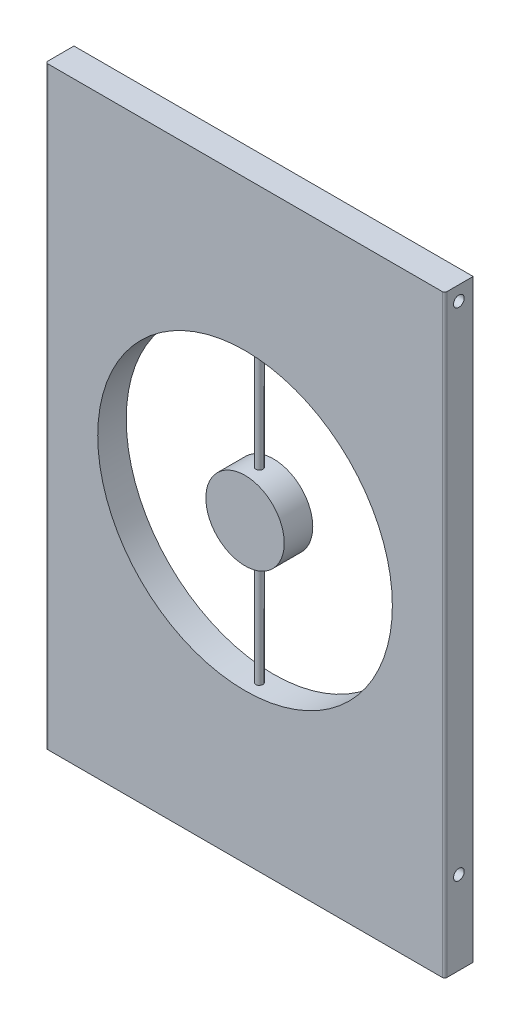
ISO-10303-21;
HEADER;
FILE_DESCRIPTION(('STEP AP214'),'2;1');
FILE_NAME('part.step','',(''),(''),'','','');
FILE_SCHEMA(('AUTOMOTIVE_DESIGN { 1 0 10303 214 1 1 1 1 }'));
ENDSEC;
DATA;
#1=APPLICATION_CONTEXT('core data for automotive mechanical design processes');
#2=APPLICATION_PROTOCOL_DEFINITION('international standard','automotive_design',2000,#1);
#3=PRODUCT_CONTEXT('',#1,'mechanical');
#4=PRODUCT('Part','Part','',(#3));
#5=PRODUCT_RELATED_PRODUCT_CATEGORY('part','',(#4));
#6=PRODUCT_DEFINITION_FORMATION('','',#4);
#7=PRODUCT_DEFINITION_CONTEXT('part definition',#1,'design');
#8=PRODUCT_DEFINITION('design','',#6,#7);
#9=PRODUCT_DEFINITION_SHAPE('','',#8);
#10=(LENGTH_UNIT() NAMED_UNIT(*) SI_UNIT(.MILLI.,.METRE.));
#11=(NAMED_UNIT(*) PLANE_ANGLE_UNIT() SI_UNIT($,.RADIAN.));
#12=(NAMED_UNIT(*) SI_UNIT($,.STERADIAN.) SOLID_ANGLE_UNIT());
#13=UNCERTAINTY_MEASURE_WITH_UNIT(LENGTH_MEASURE(1.E-05),#10,'distance_accuracy_value','');
#14=(GEOMETRIC_REPRESENTATION_CONTEXT(3) GLOBAL_UNCERTAINTY_ASSIGNED_CONTEXT((#13)) GLOBAL_UNIT_ASSIGNED_CONTEXT((#10,
#11,#12)) REPRESENTATION_CONTEXT('',''));
#15=CARTESIAN_POINT('',(0.,0.,0.));
#16=DIRECTION('',(0.,0.,1.));
#17=DIRECTION('',(1.,0.,0.));
#18=AXIS2_PLACEMENT_3D('',#15,#16,#17);
#19=CARTESIAN_POINT('',(144.,67.,99.));
#20=DIRECTION('',(0.,1.,0.));
#21=DIRECTION('',(0.,0.,1.));
#22=AXIS2_PLACEMENT_3D('',#19,#20,#21);
#23=CYLINDRICAL_SURFACE('',#22,1.5);
#24=CARTESIAN_POINT('',(144.,120.5,100.5));
#25=CARTESIAN_POINT('',(144.084069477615,120.500000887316,100.499996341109));
#26=CARTESIAN_POINT('',(144.168195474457,120.500649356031,100.492908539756));
#27=CARTESIAN_POINT('',(144.334117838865,120.503173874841,100.464739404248));
#28=CARTESIAN_POINT('',(144.415911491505,120.505051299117,100.44364240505));
#29=CARTESIAN_POINT('',(144.574742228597,120.509821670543,100.388071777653));
#30=CARTESIAN_POINT('',(144.651782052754,120.512714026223,100.353605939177));
#31=CARTESIAN_POINT('',(144.798965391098,120.519190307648,100.272290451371));
#32=CARTESIAN_POINT('',(144.869110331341,120.522774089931,100.225443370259));
#33=CARTESIAN_POINT('',(145.000741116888,120.530243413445,100.120543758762));
#34=CARTESIAN_POINT('',(145.062203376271,120.534129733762,100.062461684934));
#35=CARTESIAN_POINT('',(145.17452157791,120.541759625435,99.9368035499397));
#36=CARTESIAN_POINT('',(145.225377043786,120.545503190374,99.8692270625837));
#37=CARTESIAN_POINT('',(145.315119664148,120.552431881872,99.7263532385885));
#38=CARTESIAN_POINT('',(145.353985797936,120.555616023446,99.6510426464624));
#39=CARTESIAN_POINT('',(145.418512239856,120.561056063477,99.4949305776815));
#40=CARTESIAN_POINT('',(145.44417282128,120.563311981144,99.4141292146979));
#41=CARTESIAN_POINT('',(145.481490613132,120.566633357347,99.2495676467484));
#42=CARTESIAN_POINT('',(145.493186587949,120.567702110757,99.1658163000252));
#43=CARTESIAN_POINT('',(145.502362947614,120.568538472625,98.9975329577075));
#44=CARTESIAN_POINT('',(145.499843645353,120.568306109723,98.9130009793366));
#45=CARTESIAN_POINT('',(145.480692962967,120.566569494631,98.745822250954));
#46=CARTESIAN_POINT('',(145.464103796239,120.565069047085,98.6631706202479));
#47=CARTESIAN_POINT('',(145.417349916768,120.560971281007,98.5018296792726));
#48=CARTESIAN_POINT('',(145.387185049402,120.558373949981,98.4231404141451));
#49=CARTESIAN_POINT('',(145.314089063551,120.552370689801,98.2718238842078));
#50=CARTESIAN_POINT('',(145.271139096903,120.548963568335,98.199205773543));
#51=CARTESIAN_POINT('',(145.173705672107,120.541725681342,98.0621930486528));
#52=CARTESIAN_POINT('',(145.11922193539,120.537894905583,97.99779863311));
#53=CARTESIAN_POINT('',(145.00003122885,120.530224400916,97.8788158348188));
#54=CARTESIAN_POINT('',(144.935287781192,120.526384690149,97.8242639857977));
#55=CARTESIAN_POINT('',(144.797542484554,120.51914217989,97.7267976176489));
#56=CARTESIAN_POINT('',(144.724540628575,120.515739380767,97.6838831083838));
#57=CARTESIAN_POINT('',(144.572326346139,120.509753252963,97.6109115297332));
#58=CARTESIAN_POINT('',(144.49311309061,120.507170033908,97.5808561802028));
#59=CARTESIAN_POINT('',(144.33073592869,120.503115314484,97.5344821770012));
#60=CARTESIAN_POINT('',(144.247572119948,120.50164378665,97.5181631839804));
#61=CARTESIAN_POINT('',(144.079971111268,120.499981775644,97.4997711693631));
#62=CARTESIAN_POINT('',(143.995539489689,120.499786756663,97.4976477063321));
#63=CARTESIAN_POINT('',(143.827521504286,120.500687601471,97.5075747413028));
#64=CARTESIAN_POINT('',(143.743935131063,120.501783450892,97.5196250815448));
#65=CARTESIAN_POINT('',(143.580124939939,120.505139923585,97.5575158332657));
#66=CARTESIAN_POINT('',(143.499895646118,120.507398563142,97.5833327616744));
#67=CARTESIAN_POINT('',(143.344907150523,120.512827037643,97.6479997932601));
#68=CARTESIAN_POINT('',(143.270148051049,120.515996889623,97.6868501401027));
#69=CARTESIAN_POINT('',(143.127993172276,120.522904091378,97.7766072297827));
#70=CARTESIAN_POINT('',(143.060618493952,120.526642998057,97.8275472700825));
#71=CARTESIAN_POINT('',(142.935358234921,120.534263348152,97.9399898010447));
#72=CARTESIAN_POINT('',(142.87747285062,120.538144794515,98.0014925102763));
#73=CARTESIAN_POINT('',(142.772660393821,120.545626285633,98.1335339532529));
#74=CARTESIAN_POINT('',(142.7257663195,120.549225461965,98.2040989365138));
#75=CARTESIAN_POINT('',(142.644494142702,120.555722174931,98.3521317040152));
#76=CARTESIAN_POINT('',(142.610115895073,120.558619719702,98.429599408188));
#77=CARTESIAN_POINT('',(142.554907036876,120.563379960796,98.5891233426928));
#78=CARTESIAN_POINT('',(142.534056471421,120.565244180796,98.6711726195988));
#79=CARTESIAN_POINT('',(142.506429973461,120.567731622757,98.8376252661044));
#80=CARTESIAN_POINT('',(142.499653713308,120.568354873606,98.9220285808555));
#81=CARTESIAN_POINT('',(142.500372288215,120.568289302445,99.090465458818));
#82=CARTESIAN_POINT('',(142.507815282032,120.567605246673,99.174499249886));
#83=CARTESIAN_POINT('',(142.536652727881,120.565012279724,99.3401177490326));
#84=CARTESIAN_POINT('',(142.558047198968,120.563103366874,99.4217024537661));
#85=CARTESIAN_POINT('',(142.614166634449,120.558277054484,99.580108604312));
#86=CARTESIAN_POINT('',(142.64889040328,120.555359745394,99.6569304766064));
#87=CARTESIAN_POINT('',(142.730677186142,120.548845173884,99.8036632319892));
#88=CARTESIAN_POINT('',(142.777740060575,120.545247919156,99.8735741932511));
#89=CARTESIAN_POINT('',(142.883064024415,120.537763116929,100.004766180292));
#90=CARTESIAN_POINT('',(142.941363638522,120.533874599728,100.066016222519));
#91=CARTESIAN_POINT('',(143.067432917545,120.526254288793,100.177888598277));
#92=CARTESIAN_POINT('',(143.135204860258,120.522522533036,100.228508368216));
#93=CARTESIAN_POINT('',(143.278449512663,120.515628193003,100.31776490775));
#94=CARTESIAN_POINT('',(143.353938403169,120.512466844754,100.356375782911));
#95=CARTESIAN_POINT('',(143.510306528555,120.507083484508,100.420323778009));
#96=CARTESIAN_POINT('',(143.591179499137,120.504860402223,100.445676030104));
#97=CARTESIAN_POINT('',(143.727101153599,120.502169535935,100.475988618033));
#98=CARTESIAN_POINT('',(143.781277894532,120.501359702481,100.484980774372));
#99=CARTESIAN_POINT('',(143.890295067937,120.500274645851,100.496987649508));
#100=CARTESIAN_POINT('',(143.945135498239,120.49999942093,100.500002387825));
#101=CARTESIAN_POINT('',(144.,120.5,100.5));
#102=B_SPLINE_CURVE_WITH_KNOTS('',3,(#24,#25,#26,#27,#28,#29,#30,#31,#32,#33,#34,#35,#36,#37,
#38,#39,#40,#41,#42,#43,#44,#45,#46,#47,#48,#49,#50,#51,#52,#53,#54,#55,#56,#57,#58,#59,#60,#61,
#62,#63,#64,#65,#66,#67,#68,#69,#70,#71,#72,#73,#74,#75,#76,#77,#78,#79,#80,#81,#82,#83,#84,#85,
#86,#87,#88,#89,#90,#91,#92,#93,#94,#95,#96,#97,#98,#99,#100,#101),.UNSPECIFIED.,.T.,.F.,(4,2,2,
2,2,2,2,2,2,2,2,2,2,2,2,2,2,2,2,2,2,2,2,2,2,2,2,2,2,2,2,2,2,2,2,2,2,2,4),(0.,0.252008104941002,
0.504298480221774,0.756442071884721,1.00853340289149,1.26129687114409,1.51407168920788,
1.76728720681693,2.02049748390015,2.27300322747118,2.52550341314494,2.77724869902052,
3.02899685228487,3.28111799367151,3.53324522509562,3.78628987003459,4.03933472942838,
4.29241342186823,4.5454858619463,4.79765857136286,5.04982847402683,5.30156959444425,
5.55331542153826,5.80576282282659,6.05821544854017,6.31141654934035,6.56461471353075,
6.81743852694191,7.07025645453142,7.32215440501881,7.57405269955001,7.82592840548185,
8.07780126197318,8.33055352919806,8.58336668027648,8.83672124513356,9.08978602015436,
9.25424932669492,9.41871209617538),.UNSPECIFIED.);
#103=CARTESIAN_POINT('',(144.,120.5,100.5));
#104=VERTEX_POINT('',#103);
#105=EDGE_CURVE('E194',#104,#104,#102,.T.);
#106=ORIENTED_EDGE('',*,*,#105,.F.);
#107=EDGE_LOOP('',(#106));
#108=FACE_BOUND('',#107,.T.);
#109=CARTESIAN_POINT('',(144.,75.0000000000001,100.5));
#110=CARTESIAN_POINT('',(143.915757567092,75.000000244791,100.49999626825));
#111=CARTESIAN_POINT('',(143.831454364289,75.0001735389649,100.492879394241));
#112=CARTESIAN_POINT('',(143.665170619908,75.0008481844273,100.464588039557));
#113=CARTESIAN_POINT('',(143.583192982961,75.001349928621,100.443396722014));
#114=CARTESIAN_POINT('',(143.423993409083,75.0026246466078,100.387560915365));
#115=CARTESIAN_POINT('',(143.346769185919,75.0033974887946,100.352922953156));
#116=CARTESIAN_POINT('',(143.199253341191,75.0051272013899,100.271186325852));
#117=CARTESIAN_POINT('',(143.128960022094,75.0060840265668,100.22409072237));
#118=CARTESIAN_POINT('',(142.997255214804,75.0080743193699,100.118755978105));
#119=CARTESIAN_POINT('',(142.93584628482,75.0091078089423,100.060513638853));
#120=CARTESIAN_POINT('',(142.823674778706,75.0111347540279,99.9345437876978));
#121=CARTESIAN_POINT('',(142.772912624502,75.0121282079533,99.8668159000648));
#122=CARTESIAN_POINT('',(142.683473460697,75.0139631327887,99.7237903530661));
#123=CARTESIAN_POINT('',(142.644797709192,75.014804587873,99.6484919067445));
#124=CARTESIAN_POINT('',(142.580637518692,75.0162404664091,99.4924683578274));
#125=CARTESIAN_POINT('',(142.555153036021,75.0168348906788,99.4117432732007));
#126=CARTESIAN_POINT('',(142.518103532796,75.0177095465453,99.2471746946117));
#127=CARTESIAN_POINT('',(142.506535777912,75.0179898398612,99.1633318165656));
#128=CARTESIAN_POINT('',(142.497639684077,75.0182048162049,98.9948937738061));
#129=CARTESIAN_POINT('',(142.50031129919,75.0181395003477,98.9102986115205));
#130=CARTESIAN_POINT('',(142.519815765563,75.0176706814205,98.7427759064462));
#131=CARTESIAN_POINT('',(142.536645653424,75.0172672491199,98.6598480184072));
#132=CARTESIAN_POINT('',(142.583984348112,75.0161677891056,98.4979949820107));
#133=CARTESIAN_POINT('',(142.614493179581,75.0154717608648,98.4190698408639));
#134=CARTESIAN_POINT('',(142.688327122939,75.0138654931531,98.2674532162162));
#135=CARTESIAN_POINT('',(142.731653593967,75.0129552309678,98.1947623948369));
#136=CARTESIAN_POINT('',(142.829891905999,75.0110231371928,98.0576851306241));
#137=CARTESIAN_POINT('',(142.884803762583,75.0100013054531,97.9932986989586));
#138=CARTESIAN_POINT('',(143.004670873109,75.0079609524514,97.874640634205));
#139=CARTESIAN_POINT('',(143.069628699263,75.0069424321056,97.8203715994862));
#140=CARTESIAN_POINT('',(143.207734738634,75.0050237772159,97.7235088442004));
#141=CARTESIAN_POINT('',(143.280882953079,75.0041236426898,97.6809151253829));
#142=CARTESIAN_POINT('',(143.43329476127,75.0025432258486,97.6086123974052));
#143=CARTESIAN_POINT('',(143.512558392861,75.0018629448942,97.5789034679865));
#144=CARTESIAN_POINT('',(143.67495035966,75.0007989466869,97.5332153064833));
#145=CARTESIAN_POINT('',(143.758078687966,75.0004152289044,97.5172360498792));
#146=CARTESIAN_POINT('',(143.925817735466,74.9999876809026,97.4994640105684));
#147=CARTESIAN_POINT('',(144.010428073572,74.9999437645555,97.4976676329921));
#148=CARTESIAN_POINT('',(144.178749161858,75.0002005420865,97.5083029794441));
#149=CARTESIAN_POINT('',(144.262459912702,75.0005012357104,97.5207346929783));
#150=CARTESIAN_POINT('',(144.426595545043,75.0014132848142,97.5594703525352));
#151=CARTESIAN_POINT('',(144.507020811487,75.0020246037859,97.5857726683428));
#152=CARTESIAN_POINT('',(144.662314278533,75.0034890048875,97.6515012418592));
#153=CARTESIAN_POINT('',(144.737182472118,75.0043420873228,97.6909275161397));
#154=CARTESIAN_POINT('',(144.879253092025,75.0061941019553,97.7817940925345));
#155=CARTESIAN_POINT('',(144.946453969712,75.0071930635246,97.8332368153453));
#156=CARTESIAN_POINT('',(145.071266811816,75.0092241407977,97.9466724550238));
#157=CARTESIAN_POINT('',(145.128878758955,75.0102562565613,98.0086653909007));
#158=CARTESIAN_POINT('',(145.232890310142,75.0122375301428,98.1414570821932));
#159=CARTESIAN_POINT('',(145.279287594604,75.0131866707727,98.2122576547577));
#160=CARTESIAN_POINT('',(145.359536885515,75.0148947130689,98.360645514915));
#161=CARTESIAN_POINT('',(145.393388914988,75.0156536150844,98.4382327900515));
#162=CARTESIAN_POINT('',(145.447582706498,75.0168954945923,98.5979828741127));
#163=CARTESIAN_POINT('',(145.467925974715,75.017378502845,98.6801451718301));
#164=CARTESIAN_POINT('',(145.494529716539,75.0180142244,98.8467203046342));
#165=CARTESIAN_POINT('',(145.500790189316,75.0181669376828,98.9311331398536));
#166=CARTESIAN_POINT('',(145.499050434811,75.0181248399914,99.0997898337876));
#167=CARTESIAN_POINT('',(145.491053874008,75.0179301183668,99.1840337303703));
#168=CARTESIAN_POINT('',(145.461034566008,75.0172152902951,99.349982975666));
#169=CARTESIAN_POINT('',(145.439011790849,75.0166951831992,99.4316883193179));
#170=CARTESIAN_POINT('',(145.381565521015,75.0153882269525,99.5902430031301));
#171=CARTESIAN_POINT('',(145.346141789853,75.0146013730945,99.6670922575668));
#172=CARTESIAN_POINT('',(145.262900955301,75.0128496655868,99.8137507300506));
#173=CARTESIAN_POINT('',(145.215084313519,75.0118848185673,99.8835602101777));
#174=CARTESIAN_POINT('',(145.108406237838,75.0098856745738,100.01417308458));
#175=CARTESIAN_POINT('',(145.049543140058,75.0088513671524,100.074975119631));
#176=CARTESIAN_POINT('',(144.922427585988,75.0068297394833,100.185850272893));
#177=CARTESIAN_POINT('',(144.854172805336,75.0058424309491,100.235920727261));
#178=CARTESIAN_POINT('',(144.710189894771,75.0040258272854,100.323917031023));
#179=CARTESIAN_POINT('',(144.634457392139,75.0031966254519,100.361835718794));
#180=CARTESIAN_POINT('',(144.47775796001,75.0017914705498,100.424376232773));
#181=CARTESIAN_POINT('',(144.396797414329,75.0012152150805,100.449013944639));
#182=CARTESIAN_POINT('',(144.262769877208,75.0005352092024,100.477750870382));
#183=CARTESIAN_POINT('',(144.210573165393,75.0003353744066,100.486083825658));
#184=CARTESIAN_POINT('',(144.105592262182,75.0000676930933,100.49720955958));
#185=CARTESIAN_POINT('',(144.052808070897,74.9999998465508,100.500002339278));
#186=CARTESIAN_POINT('',(144.,75.0000000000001,100.5));
#187=B_SPLINE_CURVE_WITH_KNOTS('',3,(#109,#110,#111,#112,#113,#114,#115,#116,#117,#118,#119,
#120,#121,#122,#123,#124,#125,#126,#127,#128,#129,#130,#131,#132,#133,#134,#135,#136,#137,#138,
#139,#140,#141,#142,#143,#144,#145,#146,#147,#148,#149,#150,#151,#152,#153,#154,#155,#156,#157,
#158,#159,#160,#161,#162,#163,#164,#165,#166,#167,#168,#169,#170,#171,#172,#173,#174,#175,#176,
#177,#178,#179,#180,#181,#182,#183,#184,#185,#186),.UNSPECIFIED.,.T.,.F.,(4,2,2,2,2,2,2,2,2,2,2,
2,2,2,2,2,2,2,2,2,2,2,2,2,2,2,2,2,2,2,2,2,2,2,2,2,2,2,4),(0.,0.252534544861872,
0.505371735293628,0.758086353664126,1.01073892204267,1.26346409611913,1.51619928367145,
1.76896077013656,2.02172141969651,2.27443239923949,2.52714256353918,2.77979984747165,
3.03245758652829,3.28514212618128,3.5378270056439,3.79057669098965,4.04332641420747,
4.29607770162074,4.54882853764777,4.80151530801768,5.05420189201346,5.30685878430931,
5.55951599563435,5.81222414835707,6.06493275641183,6.31769358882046,6.57045395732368,
6.8231861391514,7.07591833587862,7.32858554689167,7.58125326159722,7.83392543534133,
8.08658819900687,8.33928905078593,8.59205255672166,8.84496475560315,9.09757376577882,
9.25587717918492,9.41418056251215),.UNSPECIFIED.);
#188=CARTESIAN_POINT('',(144.,75.0000000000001,100.5));
#189=VERTEX_POINT('',#188);
#190=EDGE_CURVE('E154',#189,#189,#187,.T.);
#191=ORIENTED_EDGE('',*,*,#190,.F.);
#192=EDGE_LOOP('',(#191));
#193=FACE_BOUND('',#192,.T.);
#194=ADVANCED_FACE('F35',(#108,#193),#23,.T.);
#195=CARTESIAN_POINT('',(60.,12.,93.));
#196=DIRECTION('',(-1.,0.,0.));
#197=DIRECTION('',(0.,0.,1.));
#198=AXIS2_PLACEMENT_3D('',#195,#196,#197);
#199=PLANE('',#198);
#200=CARTESIAN_POINT('',(60.,256.,99.));
#201=DIRECTION('',(-1.,0.,0.));
#202=DIRECTION('',(0.,0.,1.));
#203=AXIS2_PLACEMENT_3D('',#200,#201,#202);
#204=CIRCLE('',#203,2.24999999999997);
#205=CARTESIAN_POINT('',(60.,256.,101.25));
#206=VERTEX_POINT('',#205);
#207=EDGE_CURVE('E117',#206,#206,#204,.T.);
#208=ORIENTED_EDGE('',*,*,#207,.F.);
#209=EDGE_LOOP('',(#208));
#210=FACE_BOUND('',#209,.T.);
#211=DIRECTION('',(0.,0.,1.));
#212=VECTOR('',#211,1.);
#213=CARTESIAN_POINT('',(60.,12.,93.));
#214=LINE('',#213,#212);
#215=CARTESIAN_POINT('',(60.,12.,93.));
#216=VERTEX_POINT('',#215);
#217=CARTESIAN_POINT('',(60.,12.,104.));
#218=VERTEX_POINT('',#217);
#219=EDGE_CURVE('E125',#216,#218,#214,.T.);
#220=ORIENTED_EDGE('',*,*,#219,.T.);
#221=DIRECTION('',(0.,-1.,0.));
#222=VECTOR('',#221,1.);
#223=CARTESIAN_POINT('',(60.,262.,104.));
#224=LINE('',#223,#222);
#225=CARTESIAN_POINT('',(60.,262.,104.));
#226=VERTEX_POINT('',#225);
#227=EDGE_CURVE('E58',#218,#226,#224,.F.);
#228=ORIENTED_EDGE('',*,*,#227,.T.);
#229=DIRECTION('',(0.,0.,1.));
#230=VECTOR('',#229,1.);
#231=CARTESIAN_POINT('',(60.,262.,93.));
#232=LINE('',#231,#230);
#233=CARTESIAN_POINT('',(60.,262.,93.));
#234=VERTEX_POINT('',#233);
#235=EDGE_CURVE('E137',#234,#226,#232,.T.);
#236=ORIENTED_EDGE('',*,*,#235,.F.);
#237=DIRECTION('',(0.,-1.,0.));
#238=VECTOR('',#237,1.);
#239=CARTESIAN_POINT('',(60.,12.,93.));
#240=LINE('',#239,#238);
#241=EDGE_CURVE('E128',#234,#216,#240,.T.);
#242=ORIENTED_EDGE('',*,*,#241,.T.);
#243=EDGE_LOOP('',(#220,#228,#236,#242));
#244=FACE_BOUND('',#243,.T.);
#245=ADVANCED_FACE('F183',(#210,#244),#199,.T.);
#246=CARTESIAN_POINT('',(60.,262.,93.));
#247=DIRECTION('',(0.,1.,0.));
#248=DIRECTION('',(0.,0.,1.));
#249=AXIS2_PLACEMENT_3D('',#246,#247,#248);
#250=PLANE('',#249);
#251=ORIENTED_EDGE('',*,*,#235,.T.);
#252=CARTESIAN_POINT('',(61.,262.,104.));
#253=DIRECTION('',(0.,1.,0.));
#254=DIRECTION('',(0.,0.,1.));
#255=AXIS2_PLACEMENT_3D('',#252,#253,#254);
#256=CIRCLE('',#255,1.);
#257=CARTESIAN_POINT('',(61.,262.,105.));
#258=VERTEX_POINT('',#257);
#259=EDGE_CURVE('E43',#226,#258,#256,.T.);
#260=ORIENTED_EDGE('',*,*,#259,.T.);
#261=DIRECTION('',(-1.,0.,0.));
#262=VECTOR('',#261,1.);
#263=CARTESIAN_POINT('',(60.,262.,105.));
#264=LINE('',#263,#262);
#265=CARTESIAN_POINT('',(227.,262.,105.));
#266=VERTEX_POINT('',#265);
#267=EDGE_CURVE('E139',#266,#258,#264,.T.);
#268=ORIENTED_EDGE('',*,*,#267,.F.);
#269=CARTESIAN_POINT('',(227.,262.,104.));
#270=DIRECTION('',(0.,1.,0.));
#271=DIRECTION('',(0.,0.,1.));
#272=AXIS2_PLACEMENT_3D('',#269,#270,#271);
#273=CIRCLE('',#272,1.);
#274=CARTESIAN_POINT('',(228.,262.,104.));
#275=VERTEX_POINT('',#274);
#276=EDGE_CURVE('E50',#266,#275,#273,.T.);
#277=ORIENTED_EDGE('',*,*,#276,.T.);
#278=DIRECTION('',(0.,0.,1.));
#279=VECTOR('',#278,1.);
#280=CARTESIAN_POINT('',(228.,262.,93.));
#281=LINE('',#280,#279);
#282=CARTESIAN_POINT('',(228.,262.,93.));
#283=VERTEX_POINT('',#282);
#284=EDGE_CURVE('E134',#283,#275,#281,.T.);
#285=ORIENTED_EDGE('',*,*,#284,.F.);
#286=DIRECTION('',(-1.,0.,0.));
#287=VECTOR('',#286,1.);
#288=CARTESIAN_POINT('',(60.,262.,93.));
#289=LINE('',#288,#287);
#290=EDGE_CURVE('E127',#283,#234,#289,.T.);
#291=ORIENTED_EDGE('',*,*,#290,.T.);
#292=EDGE_LOOP('',(#251,#260,#268,#277,#285,#291));
#293=FACE_BOUND('',#292,.T.);
#294=ADVANCED_FACE('F221',(#293),#250,.T.);
#295=CARTESIAN_POINT('',(228.,12.,93.));
#296=DIRECTION('',(1.,0.,0.));
#297=DIRECTION('',(0.,0.,-1.));
#298=AXIS2_PLACEMENT_3D('',#295,#296,#297);
#299=PLANE('',#298);
#300=CARTESIAN_POINT('',(228.,256.,99.));
#301=DIRECTION('',(1.,0.,0.));
#302=DIRECTION('',(0.,0.,-1.));
#303=AXIS2_PLACEMENT_3D('',#300,#301,#302);
#304=CIRCLE('',#303,2.24999999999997);
#305=CARTESIAN_POINT('',(228.,256.,96.75));
#306=VERTEX_POINT('',#305);
#307=EDGE_CURVE('E105',#306,#306,#304,.T.);
#308=ORIENTED_EDGE('',*,*,#307,.F.);
#309=EDGE_LOOP('',(#308));
#310=FACE_BOUND('',#309,.T.);
#311=CARTESIAN_POINT('',(228.,47.,98.9999999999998));
#312=DIRECTION('',(1.,0.,0.));
#313=DIRECTION('',(0.,0.,-1.));
#314=AXIS2_PLACEMENT_3D('',#311,#312,#313);
#315=CIRCLE('',#314,2.25);
#316=CARTESIAN_POINT('',(228.,47.,96.7499999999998));
#317=VERTEX_POINT('',#316);
#318=EDGE_CURVE('E113',#317,#317,#315,.T.);
#319=ORIENTED_EDGE('',*,*,#318,.F.);
#320=EDGE_LOOP('',(#319));
#321=FACE_BOUND('',#320,.T.);
#322=ORIENTED_EDGE('',*,*,#284,.T.);
#323=DIRECTION('',(0.,1.,0.));
#324=VECTOR('',#323,1.);
#325=CARTESIAN_POINT('',(228.,12.,104.));
#326=LINE('',#325,#324);
#327=CARTESIAN_POINT('',(228.,12.,104.));
#328=VERTEX_POINT('',#327);
#329=EDGE_CURVE('E11',#275,#328,#326,.F.);
#330=ORIENTED_EDGE('',*,*,#329,.T.);
#331=DIRECTION('',(0.,0.,1.));
#332=VECTOR('',#331,1.);
#333=CARTESIAN_POINT('',(228.,12.,93.));
#334=LINE('',#333,#332);
#335=CARTESIAN_POINT('',(228.,12.,93.));
#336=VERTEX_POINT('',#335);
#337=EDGE_CURVE('E129',#336,#328,#334,.T.);
#338=ORIENTED_EDGE('',*,*,#337,.F.);
#339=DIRECTION('',(0.,1.,0.));
#340=VECTOR('',#339,1.);
#341=CARTESIAN_POINT('',(228.,12.,93.));
#342=LINE('',#341,#340);
#343=EDGE_CURVE('E136',#336,#283,#342,.T.);
#344=ORIENTED_EDGE('',*,*,#343,.T.);
#345=EDGE_LOOP('',(#322,#330,#338,#344));
#346=FACE_BOUND('',#345,.T.);
#347=ADVANCED_FACE('F270',(#310,#321,#346),#299,.T.);
#348=CARTESIAN_POINT('',(60.,12.,93.));
#349=DIRECTION('',(0.,-1.,0.));
#350=DIRECTION('',(0.,0.,-1.));
#351=AXIS2_PLACEMENT_3D('',#348,#349,#350);
#352=PLANE('',#351);
#353=DIRECTION('',(1.,0.,0.));
#354=VECTOR('',#353,1.);
#355=CARTESIAN_POINT('',(60.,12.,105.));
#356=LINE('',#355,#354);
#357=CARTESIAN_POINT('',(61.,12.,105.));
#358=VERTEX_POINT('',#357);
#359=CARTESIAN_POINT('',(227.,12.,105.));
#360=VERTEX_POINT('',#359);
#361=EDGE_CURVE('E143',#358,#360,#356,.T.);
#362=ORIENTED_EDGE('',*,*,#361,.F.);
#363=CARTESIAN_POINT('',(61.,12.,104.));
#364=DIRECTION('',(0.,-1.,0.));
#365=DIRECTION('',(0.,0.,-1.));
#366=AXIS2_PLACEMENT_3D('',#363,#364,#365);
#367=CIRCLE('',#366,1.);
#368=EDGE_CURVE('E251',#358,#218,#367,.T.);
#369=ORIENTED_EDGE('',*,*,#368,.T.);
#370=ORIENTED_EDGE('',*,*,#219,.F.);
#371=DIRECTION('',(1.,0.,0.));
#372=VECTOR('',#371,1.);
#373=CARTESIAN_POINT('',(60.,12.,93.));
#374=LINE('',#373,#372);
#375=EDGE_CURVE('E133',#216,#336,#374,.T.);
#376=ORIENTED_EDGE('',*,*,#375,.T.);
#377=ORIENTED_EDGE('',*,*,#337,.T.);
#378=CARTESIAN_POINT('',(227.,12.,104.));
#379=DIRECTION('',(0.,-1.,0.));
#380=DIRECTION('',(0.,0.,-1.));
#381=AXIS2_PLACEMENT_3D('',#378,#379,#380);
#382=CIRCLE('',#381,1.);
#383=EDGE_CURVE('E252',#328,#360,#382,.T.);
#384=ORIENTED_EDGE('',*,*,#383,.T.);
#385=EDGE_LOOP('',(#362,#369,#370,#376,#377,#384));
#386=FACE_BOUND('',#385,.T.);
#387=ADVANCED_FACE('F265',(#386),#352,.T.);
#388=CARTESIAN_POINT('',(0.,0.,93.));
#389=DIRECTION('',(0.,0.,-1.));
#390=DIRECTION('',(-1.,0.,0.));
#391=AXIS2_PLACEMENT_3D('',#388,#389,#390);
#392=PLANE('',#391);
#393=CARTESIAN_POINT('',(144.,137.,93.));
#394=DIRECTION('',(0.,0.,1.));
#395=DIRECTION('',(1.,0.,0.));
#396=AXIS2_PLACEMENT_3D('',#393,#394,#395);
#397=CIRCLE('',#396,62.);
#398=CARTESIAN_POINT('',(206.,137.,93.));
#399=VERTEX_POINT('',#398);
#400=EDGE_CURVE('E132',#399,#399,#397,.T.);
#401=ORIENTED_EDGE('',*,*,#400,.T.);
#402=EDGE_LOOP('',(#401));
#403=FACE_BOUND('',#402,.T.);
#404=ORIENTED_EDGE('',*,*,#241,.F.);
#405=ORIENTED_EDGE('',*,*,#290,.F.);
#406=ORIENTED_EDGE('',*,*,#343,.F.);
#407=ORIENTED_EDGE('',*,*,#375,.F.);
#408=EDGE_LOOP('',(#404,#405,#406,#407));
#409=FACE_BOUND('',#408,.T.);
#410=ADVANCED_FACE('F240',(#403,#409),#392,.T.);
#411=CARTESIAN_POINT('',(0.,0.,105.));
#412=DIRECTION('',(0.,0.,-1.));
#413=DIRECTION('',(-1.,0.,0.));
#414=AXIS2_PLACEMENT_3D('',#411,#412,#413);
#415=PLANE('',#414);
#416=CARTESIAN_POINT('',(144.,137.,105.));
#417=DIRECTION('',(0.,0.,1.));
#418=DIRECTION('',(1.,0.,0.));
#419=AXIS2_PLACEMENT_3D('',#416,#417,#418);
#420=CIRCLE('',#419,62.);
#421=CARTESIAN_POINT('',(206.,137.,105.));
#422=VERTEX_POINT('',#421);
#423=EDGE_CURVE('E142',#422,#422,#420,.T.);
#424=ORIENTED_EDGE('',*,*,#423,.F.);
#425=EDGE_LOOP('',(#424));
#426=FACE_BOUND('',#425,.T.);
#427=ORIENTED_EDGE('',*,*,#267,.T.);
#428=DIRECTION('',(0.,-1.,0.));
#429=VECTOR('',#428,1.);
#430=CARTESIAN_POINT('',(61.,12.,105.));
#431=LINE('',#430,#429);
#432=EDGE_CURVE('E244',#258,#358,#431,.T.);
#433=ORIENTED_EDGE('',*,*,#432,.T.);
#434=ORIENTED_EDGE('',*,*,#361,.T.);
#435=DIRECTION('',(0.,1.,0.));
#436=VECTOR('',#435,1.);
#437=CARTESIAN_POINT('',(227.,262.,105.));
#438=LINE('',#437,#436);
#439=EDGE_CURVE('E247',#360,#266,#438,.T.);
#440=ORIENTED_EDGE('',*,*,#439,.T.);
#441=EDGE_LOOP('',(#427,#433,#434,#440));
#442=FACE_BOUND('',#441,.T.);
#443=ADVANCED_FACE('F231',(#426,#442),#415,.F.);
#444=CARTESIAN_POINT('',(144.,137.,93.));
#445=DIRECTION('',(0.,0.,1.));
#446=DIRECTION('',(1.,0.,0.));
#447=AXIS2_PLACEMENT_3D('',#444,#445,#446);
#448=CYLINDRICAL_SURFACE('',#447,62.);
#449=ORIENTED_EDGE('',*,*,#190,.T.);
#450=EDGE_LOOP('',(#449));
#451=FACE_BOUND('',#450,.T.);
#452=CARTESIAN_POINT('',(144.,199.,100.5));
#453=CARTESIAN_POINT('',(144.084242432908,198.999999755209,100.49999626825));
#454=CARTESIAN_POINT('',(144.168545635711,198.999826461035,100.492879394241));
#455=CARTESIAN_POINT('',(144.334829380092,198.999151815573,100.464588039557));
#456=CARTESIAN_POINT('',(144.416807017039,198.998650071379,100.443396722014));
#457=CARTESIAN_POINT('',(144.576006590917,198.997375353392,100.387560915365));
#458=CARTESIAN_POINT('',(144.653230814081,198.996602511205,100.352922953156));
#459=CARTESIAN_POINT('',(144.800746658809,198.99487279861,100.271186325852));
#460=CARTESIAN_POINT('',(144.871039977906,198.993915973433,100.22409072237));
#461=CARTESIAN_POINT('',(145.002744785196,198.99192568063,100.118755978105));
#462=CARTESIAN_POINT('',(145.06415371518,198.990892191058,100.060513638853));
#463=CARTESIAN_POINT('',(145.176325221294,198.988865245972,99.9345437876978));
#464=CARTESIAN_POINT('',(145.227087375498,198.987871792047,99.8668159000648));
#465=CARTESIAN_POINT('',(145.316526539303,198.986036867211,99.7237903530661));
#466=CARTESIAN_POINT('',(145.355202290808,198.985195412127,99.6484919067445));
#467=CARTESIAN_POINT('',(145.419362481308,198.983759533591,99.4924683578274));
#468=CARTESIAN_POINT('',(145.444846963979,198.983165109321,99.4117432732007));
#469=CARTESIAN_POINT('',(145.481896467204,198.982290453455,99.2471746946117));
#470=CARTESIAN_POINT('',(145.493464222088,198.982010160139,99.1633318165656));
#471=CARTESIAN_POINT('',(145.502360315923,198.981795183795,98.9948937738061));
#472=CARTESIAN_POINT('',(145.49968870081,198.981860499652,98.9102986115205));
#473=CARTESIAN_POINT('',(145.480184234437,198.98232931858,98.7427759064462));
#474=CARTESIAN_POINT('',(145.463354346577,198.98273275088,98.6598480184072));
#475=CARTESIAN_POINT('',(145.416015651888,198.983832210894,98.4979949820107));
#476=CARTESIAN_POINT('',(145.385506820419,198.984528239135,98.4190698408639));
#477=CARTESIAN_POINT('',(145.311672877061,198.986134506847,98.2674532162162));
#478=CARTESIAN_POINT('',(145.268346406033,198.987044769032,98.1947623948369));
#479=CARTESIAN_POINT('',(145.170108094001,198.988976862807,98.0576851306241));
#480=CARTESIAN_POINT('',(145.115196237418,198.989998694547,97.9932986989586));
#481=CARTESIAN_POINT('',(144.995329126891,198.992039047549,97.874640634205));
#482=CARTESIAN_POINT('',(144.930371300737,198.993057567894,97.8203715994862));
#483=CARTESIAN_POINT('',(144.792265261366,198.994976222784,97.7235088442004));
#484=CARTESIAN_POINT('',(144.719117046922,198.99587635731,97.6809151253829));
#485=CARTESIAN_POINT('',(144.56670523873,198.997456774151,97.6086123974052));
#486=CARTESIAN_POINT('',(144.487441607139,198.998137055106,97.5789034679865));
#487=CARTESIAN_POINT('',(144.32504964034,198.999201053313,97.5332153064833));
#488=CARTESIAN_POINT('',(144.241921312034,198.999584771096,97.5172360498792));
#489=CARTESIAN_POINT('',(144.074182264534,199.000012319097,97.4994640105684));
#490=CARTESIAN_POINT('',(143.989571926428,199.000056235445,97.4976676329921));
#491=CARTESIAN_POINT('',(143.821250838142,198.999799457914,97.5083029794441));
#492=CARTESIAN_POINT('',(143.737540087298,198.99949876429,97.5207346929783));
#493=CARTESIAN_POINT('',(143.573404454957,198.998586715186,97.5594703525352));
#494=CARTESIAN_POINT('',(143.492979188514,198.997975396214,97.5857726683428));
#495=CARTESIAN_POINT('',(143.337685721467,198.996510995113,97.6515012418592));
#496=CARTESIAN_POINT('',(143.262817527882,198.995657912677,97.6909275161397));
#497=CARTESIAN_POINT('',(143.120746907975,198.993805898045,97.7817940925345));
#498=CARTESIAN_POINT('',(143.053546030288,198.992806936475,97.8332368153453));
#499=CARTESIAN_POINT('',(142.928733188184,198.990775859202,97.9466724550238));
#500=CARTESIAN_POINT('',(142.871121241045,198.989743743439,98.0086653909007));
#501=CARTESIAN_POINT('',(142.767109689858,198.987762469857,98.1414570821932));
#502=CARTESIAN_POINT('',(142.720712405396,198.986813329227,98.2122576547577));
#503=CARTESIAN_POINT('',(142.640463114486,198.985105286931,98.360645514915));
#504=CARTESIAN_POINT('',(142.606611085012,198.984346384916,98.4382327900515));
#505=CARTESIAN_POINT('',(142.552417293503,198.983104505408,98.5979828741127));
#506=CARTESIAN_POINT('',(142.532074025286,198.982621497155,98.6801451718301));
#507=CARTESIAN_POINT('',(142.505470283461,198.9819857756,98.8467203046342));
#508=CARTESIAN_POINT('',(142.499209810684,198.981833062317,98.9311331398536));
#509=CARTESIAN_POINT('',(142.500949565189,198.981875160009,99.0997898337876));
#510=CARTESIAN_POINT('',(142.508946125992,198.982069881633,99.1840337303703));
#511=CARTESIAN_POINT('',(142.538965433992,198.982784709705,99.349982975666));
#512=CARTESIAN_POINT('',(142.560988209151,198.983304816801,99.4316883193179));
#513=CARTESIAN_POINT('',(142.618434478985,198.984611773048,99.5902430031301));
#514=CARTESIAN_POINT('',(142.653858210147,198.985398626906,99.6670922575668));
#515=CARTESIAN_POINT('',(142.737099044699,198.987150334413,99.8137507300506));
#516=CARTESIAN_POINT('',(142.784915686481,198.988115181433,99.8835602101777));
#517=CARTESIAN_POINT('',(142.891593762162,198.990114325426,100.01417308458));
#518=CARTESIAN_POINT('',(142.950456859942,198.991148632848,100.074975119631));
#519=CARTESIAN_POINT('',(143.077572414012,198.993170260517,100.185850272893));
#520=CARTESIAN_POINT('',(143.145827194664,198.994157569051,100.235920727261));
#521=CARTESIAN_POINT('',(143.289810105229,198.995974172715,100.323917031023));
#522=CARTESIAN_POINT('',(143.365542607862,198.996803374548,100.361835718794));
#523=CARTESIAN_POINT('',(143.52224203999,198.99820852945,100.424376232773));
#524=CARTESIAN_POINT('',(143.603202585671,198.998784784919,100.449013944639));
#525=CARTESIAN_POINT('',(143.737230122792,198.999464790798,100.477750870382));
#526=CARTESIAN_POINT('',(143.789426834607,198.999664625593,100.486083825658));
#527=CARTESIAN_POINT('',(143.894407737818,198.999932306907,100.49720955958));
#528=CARTESIAN_POINT('',(143.947191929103,199.000000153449,100.500002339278));
#529=CARTESIAN_POINT('',(144.,199.,100.5));
#530=B_SPLINE_CURVE_WITH_KNOTS('',3,(#452,#453,#454,#455,#456,#457,#458,#459,#460,#461,#462,
#463,#464,#465,#466,#467,#468,#469,#470,#471,#472,#473,#474,#475,#476,#477,#478,#479,#480,#481,
#482,#483,#484,#485,#486,#487,#488,#489,#490,#491,#492,#493,#494,#495,#496,#497,#498,#499,#500,
#501,#502,#503,#504,#505,#506,#507,#508,#509,#510,#511,#512,#513,#514,#515,#516,#517,#518,#519,
#520,#521,#522,#523,#524,#525,#526,#527,#528,#529),.UNSPECIFIED.,.T.,.F.,(4,2,2,2,2,2,2,2,2,2,2,
2,2,2,2,2,2,2,2,2,2,2,2,2,2,2,2,2,2,2,2,2,2,2,2,2,2,2,4),(0.,0.252534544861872,
0.505371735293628,0.758086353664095,1.01073892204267,1.26346409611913,1.51619928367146,
1.76896077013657,2.02172141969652,2.27443239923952,2.52714256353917,2.77979984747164,
3.03245758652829,3.28514212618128,3.5378270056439,3.79057669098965,4.04332641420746,
4.29607770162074,4.54882853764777,4.8015153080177,5.05420189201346,5.30685878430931,
5.55951599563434,5.81222414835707,6.06493275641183,6.31769358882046,6.57045395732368,
6.82318613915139,7.07591833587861,7.32858554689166,7.58125326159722,7.83392543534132,
8.08658819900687,8.33928905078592,8.59205255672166,8.84496475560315,9.09757376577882,
9.25587717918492,9.41418056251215),.UNSPECIFIED.);
#531=CARTESIAN_POINT('',(144.,199.,100.5));
#532=VERTEX_POINT('',#531);
#533=EDGE_CURVE('E121',#532,#532,#530,.T.);
#534=ORIENTED_EDGE('',*,*,#533,.T.);
#535=EDGE_LOOP('',(#534));
#536=FACE_BOUND('',#535,.T.);
#537=ORIENTED_EDGE('',*,*,#400,.F.);
#538=EDGE_LOOP('',(#537));
#539=FACE_BOUND('',#538,.T.);
#540=ORIENTED_EDGE('',*,*,#423,.T.);
#541=EDGE_LOOP('',(#540));
#542=FACE_BOUND('',#541,.T.);
#543=ADVANCED_FACE('F171',(#451,#536,#539,#542),#448,.F.);
#544=CARTESIAN_POINT('',(144.,153.5,100.5));
#545=CARTESIAN_POINT('',(143.915930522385,153.499999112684,100.499996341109));
#546=CARTESIAN_POINT('',(143.831804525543,153.499350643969,100.492908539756));
#547=CARTESIAN_POINT('',(143.665882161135,153.496826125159,100.464739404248));
#548=CARTESIAN_POINT('',(143.584088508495,153.494948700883,100.44364240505));
#549=CARTESIAN_POINT('',(143.425257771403,153.490178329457,100.388071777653));
#550=CARTESIAN_POINT('',(143.348217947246,153.487285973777,100.353605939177));
#551=CARTESIAN_POINT('',(143.201034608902,153.480809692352,100.272290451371));
#552=CARTESIAN_POINT('',(143.130889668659,153.477225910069,100.225443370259));
#553=CARTESIAN_POINT('',(142.999258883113,153.469756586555,100.120543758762));
#554=CARTESIAN_POINT('',(142.937796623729,153.465870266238,100.062461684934));
#555=CARTESIAN_POINT('',(142.82547842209,153.458240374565,99.9368035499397));
#556=CARTESIAN_POINT('',(142.774622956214,153.454496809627,99.8692270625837));
#557=CARTESIAN_POINT('',(142.684880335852,153.447568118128,99.7263532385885));
#558=CARTESIAN_POINT('',(142.646014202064,153.444383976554,99.6510426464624));
#559=CARTESIAN_POINT('',(142.581487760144,153.438943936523,99.4949305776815));
#560=CARTESIAN_POINT('',(142.55582717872,153.436688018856,99.4141292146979));
#561=CARTESIAN_POINT('',(142.518509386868,153.433366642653,99.2495676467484));
#562=CARTESIAN_POINT('',(142.506813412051,153.432297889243,99.1658163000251));
#563=CARTESIAN_POINT('',(142.497637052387,153.431461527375,98.9975329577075));
#564=CARTESIAN_POINT('',(142.500156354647,153.431693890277,98.9130009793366));
#565=CARTESIAN_POINT('',(142.519307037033,153.433430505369,98.745822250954));
#566=CARTESIAN_POINT('',(142.535896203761,153.434930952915,98.6631706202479));
#567=CARTESIAN_POINT('',(142.582650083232,153.439028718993,98.5018296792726));
#568=CARTESIAN_POINT('',(142.612814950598,153.441626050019,98.4231404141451));
#569=CARTESIAN_POINT('',(142.685910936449,153.447629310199,98.2718238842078));
#570=CARTESIAN_POINT('',(142.728860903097,153.451036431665,98.199205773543));
#571=CARTESIAN_POINT('',(142.826294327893,153.458274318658,98.0621930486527));
#572=CARTESIAN_POINT('',(142.88077806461,153.462105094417,97.99779863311));
#573=CARTESIAN_POINT('',(142.99996877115,153.469775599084,97.8788158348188));
#574=CARTESIAN_POINT('',(143.064712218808,153.473615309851,97.8242639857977));
#575=CARTESIAN_POINT('',(143.202457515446,153.48085782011,97.7267976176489));
#576=CARTESIAN_POINT('',(143.275459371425,153.484260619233,97.6838831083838));
#577=CARTESIAN_POINT('',(143.427673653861,153.490246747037,97.6109115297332));
#578=CARTESIAN_POINT('',(143.50688690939,153.492829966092,97.5808561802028));
#579=CARTESIAN_POINT('',(143.66926407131,153.496884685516,97.5344821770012));
#580=CARTESIAN_POINT('',(143.752427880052,153.49835621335,97.5181631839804));
#581=CARTESIAN_POINT('',(143.920028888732,153.500018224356,97.4997711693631));
#582=CARTESIAN_POINT('',(144.004460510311,153.500213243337,97.4976477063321));
#583=CARTESIAN_POINT('',(144.172478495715,153.499312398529,97.5075747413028));
#584=CARTESIAN_POINT('',(144.256064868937,153.498216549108,97.5196250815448));
#585=CARTESIAN_POINT('',(144.419875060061,153.494860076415,97.5575158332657));
#586=CARTESIAN_POINT('',(144.500104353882,153.492601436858,97.5833327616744));
#587=CARTESIAN_POINT('',(144.655092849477,153.487172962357,97.6479997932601));
#588=CARTESIAN_POINT('',(144.729851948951,153.484003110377,97.6868501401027));
#589=CARTESIAN_POINT('',(144.872006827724,153.477095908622,97.7766072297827));
#590=CARTESIAN_POINT('',(144.939381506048,153.473357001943,97.8275472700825));
#591=CARTESIAN_POINT('',(145.06464176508,153.465736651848,97.9399898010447));
#592=CARTESIAN_POINT('',(145.122527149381,153.461855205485,98.0014925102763));
#593=CARTESIAN_POINT('',(145.227339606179,153.454373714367,98.1335339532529));
#594=CARTESIAN_POINT('',(145.2742336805,153.450774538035,98.2040989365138));
#595=CARTESIAN_POINT('',(145.355505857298,153.444277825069,98.3521317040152));
#596=CARTESIAN_POINT('',(145.389884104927,153.441380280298,98.429599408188));
#597=CARTESIAN_POINT('',(145.445092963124,153.436620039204,98.5891233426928));
#598=CARTESIAN_POINT('',(145.46594352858,153.434755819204,98.6711726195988));
#599=CARTESIAN_POINT('',(145.493570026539,153.432268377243,98.8376252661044));
#600=CARTESIAN_POINT('',(145.500346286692,153.431645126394,98.9220285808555));
#601=CARTESIAN_POINT('',(145.499627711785,153.431710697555,99.090465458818));
#602=CARTESIAN_POINT('',(145.492184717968,153.432394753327,99.174499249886));
#603=CARTESIAN_POINT('',(145.463347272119,153.434987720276,99.3401177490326));
#604=CARTESIAN_POINT('',(145.441952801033,153.436896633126,99.4217024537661));
#605=CARTESIAN_POINT('',(145.385833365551,153.441722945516,99.580108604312));
#606=CARTESIAN_POINT('',(145.35110959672,153.444640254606,99.6569304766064));
#607=CARTESIAN_POINT('',(145.269322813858,153.451154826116,99.8036632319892));
#608=CARTESIAN_POINT('',(145.222259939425,153.454752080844,99.8735741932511));
#609=CARTESIAN_POINT('',(145.116935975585,153.462236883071,100.004766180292));
#610=CARTESIAN_POINT('',(145.058636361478,153.466125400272,100.066016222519));
#611=CARTESIAN_POINT('',(144.932567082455,153.473745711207,100.177888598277));
#612=CARTESIAN_POINT('',(144.864795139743,153.477477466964,100.228508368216));
#613=CARTESIAN_POINT('',(144.721550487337,153.484371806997,100.31776490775));
#614=CARTESIAN_POINT('',(144.646061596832,153.487533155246,100.356375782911));
#615=CARTESIAN_POINT('',(144.489693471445,153.492916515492,100.420323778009));
#616=CARTESIAN_POINT('',(144.408820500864,153.495139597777,100.445676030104));
#617=CARTESIAN_POINT('',(144.272898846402,153.497830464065,100.475988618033));
#618=CARTESIAN_POINT('',(144.218722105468,153.498640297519,100.484980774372));
#619=CARTESIAN_POINT('',(144.109704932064,153.499725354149,100.496987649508));
#620=CARTESIAN_POINT('',(144.054864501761,153.50000057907,100.500002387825));
#621=CARTESIAN_POINT('',(144.,153.5,100.5));
#622=B_SPLINE_CURVE_WITH_KNOTS('',3,(#544,#545,#546,#547,#548,#549,#550,#551,#552,#553,#554,
#555,#556,#557,#558,#559,#560,#561,#562,#563,#564,#565,#566,#567,#568,#569,#570,#571,#572,#573,
#574,#575,#576,#577,#578,#579,#580,#581,#582,#583,#584,#585,#586,#587,#588,#589,#590,#591,#592,
#593,#594,#595,#596,#597,#598,#599,#600,#601,#602,#603,#604,#605,#606,#607,#608,#609,#610,#611,
#612,#613,#614,#615,#616,#617,#618,#619,#620,#621),.UNSPECIFIED.,.T.,.F.,(4,2,2,2,2,2,2,2,2,2,2,
2,2,2,2,2,2,2,2,2,2,2,2,2,2,2,2,2,2,2,2,2,2,2,2,2,2,2,4),(0.,0.252008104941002,
0.504298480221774,0.756442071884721,1.00853340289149,1.26129687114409,1.51407168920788,
1.76728720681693,2.02049748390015,2.27300322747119,2.52550341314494,2.77724869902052,
3.02899685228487,3.28111799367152,3.53324522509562,3.78628987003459,4.03933472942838,
4.29241342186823,4.5454858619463,4.79765857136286,5.04982847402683,5.30156959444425,
5.55331542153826,5.80576282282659,6.05821544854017,6.31141654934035,6.56461471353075,
6.81743852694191,7.07025645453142,7.32215440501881,7.57405269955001,7.82592840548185,
8.07780126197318,8.33055352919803,8.58336668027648,8.83672124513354,9.08978602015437,
9.25424932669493,9.41871209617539),.UNSPECIFIED.);
#623=CARTESIAN_POINT('',(144.,153.5,100.5));
#624=VERTEX_POINT('',#623);
#625=EDGE_CURVE('E157',#624,#624,#622,.T.);
#626=ORIENTED_EDGE('',*,*,#625,.F.);
#627=EDGE_LOOP('',(#626));
#628=FACE_BOUND('',#627,.T.);
#629=ORIENTED_EDGE('',*,*,#533,.F.);
#630=EDGE_LOOP('',(#629));
#631=FACE_BOUND('',#630,.T.);
#632=ADVANCED_FACE('F175',(#628,#631),#23,.T.);
#633=CARTESIAN_POINT('',(0.,0.,105.));
#634=DIRECTION('',(0.,0.,-1.));
#635=DIRECTION('',(-1.,0.,0.));
#636=AXIS2_PLACEMENT_3D('',#633,#634,#635);
#637=PLANE('',#636);
#638=CARTESIAN_POINT('',(144.,137.,105.));
#639=DIRECTION('',(0.,0.,1.));
#640=DIRECTION('',(1.,0.,0.));
#641=AXIS2_PLACEMENT_3D('',#638,#639,#640);
#642=CIRCLE('',#641,16.5);
#643=CARTESIAN_POINT('',(160.5,137.,105.));
#644=VERTEX_POINT('',#643);
#645=EDGE_CURVE('E122',#644,#644,#642,.T.);
#646=ORIENTED_EDGE('',*,*,#645,.T.);
#647=EDGE_LOOP('',(#646));
#648=FACE_BOUND('',#647,.T.);
#649=ADVANCED_FACE('F180',(#648),#637,.F.);
#650=CARTESIAN_POINT('',(144.,137.,93.));
#651=DIRECTION('',(0.,0.,1.));
#652=DIRECTION('',(1.,0.,0.));
#653=AXIS2_PLACEMENT_3D('',#650,#651,#652);
#654=CYLINDRICAL_SURFACE('',#653,16.5);
#655=ORIENTED_EDGE('',*,*,#105,.T.);
#656=EDGE_LOOP('',(#655));
#657=FACE_BOUND('',#656,.T.);
#658=ORIENTED_EDGE('',*,*,#625,.T.);
#659=EDGE_LOOP('',(#658));
#660=FACE_BOUND('',#659,.T.);
#661=CARTESIAN_POINT('',(144.,137.,93.));
#662=DIRECTION('',(0.,0.,1.));
#663=DIRECTION('',(1.,0.,0.));
#664=AXIS2_PLACEMENT_3D('',#661,#662,#663);
#665=CIRCLE('',#664,16.5);
#666=CARTESIAN_POINT('',(160.5,137.,93.));
#667=VERTEX_POINT('',#666);
#668=EDGE_CURVE('E118',#667,#667,#665,.T.);
#669=ORIENTED_EDGE('',*,*,#668,.T.);
#670=EDGE_LOOP('',(#669));
#671=FACE_BOUND('',#670,.T.);
#672=ORIENTED_EDGE('',*,*,#645,.F.);
#673=EDGE_LOOP('',(#672));
#674=FACE_BOUND('',#673,.T.);
#675=ADVANCED_FACE('F199',(#657,#660,#671,#674),#654,.T.);
#676=CARTESIAN_POINT('',(0.,0.,93.));
#677=DIRECTION('',(0.,0.,-1.));
#678=DIRECTION('',(-1.,0.,0.));
#679=AXIS2_PLACEMENT_3D('',#676,#677,#678);
#680=PLANE('',#679);
#681=ORIENTED_EDGE('',*,*,#668,.F.);
#682=EDGE_LOOP('',(#681));
#683=FACE_BOUND('',#682,.T.);
#684=ADVANCED_FACE('F203',(#683),#680,.T.);
#685=CARTESIAN_POINT('',(76.648063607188,256.,99.));
#686=DIRECTION('',(-1.,0.,0.));
#687=DIRECTION('',(0.,0.,1.));
#688=AXIS2_PLACEMENT_3D('',#685,#686,#687);
#689=CONICAL_SURFACE('',#688,2.24999999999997,1.02974425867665);
#690=CARTESIAN_POINT('',(78.,256.,99.));
#691=VERTEX_POINT('',#690);
#692=VERTEX_LOOP('',#691);
#693=FACE_BOUND('',#692,.T.);
#694=CARTESIAN_POINT('',(76.648063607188,256.,99.));
#695=DIRECTION('',(-1.,0.,0.));
#696=DIRECTION('',(0.,0.,1.));
#697=AXIS2_PLACEMENT_3D('',#694,#695,#696);
#698=CIRCLE('',#697,2.24999999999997);
#699=CARTESIAN_POINT('',(76.648063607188,256.,101.25));
#700=VERTEX_POINT('',#699);
#701=EDGE_CURVE('E114',#700,#700,#698,.T.);
#702=ORIENTED_EDGE('',*,*,#701,.T.);
#703=EDGE_LOOP('',(#702));
#704=FACE_BOUND('',#703,.T.);
#705=ADVANCED_FACE('F205',(#693,#704),#689,.F.);
#706=CARTESIAN_POINT('',(48.,256.,99.));
#707=DIRECTION('',(-1.,0.,0.));
#708=DIRECTION('',(0.,0.,1.));
#709=AXIS2_PLACEMENT_3D('',#706,#707,#708);
#710=CYLINDRICAL_SURFACE('',#709,2.24999999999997);
#711=ORIENTED_EDGE('',*,*,#207,.T.);
#712=EDGE_LOOP('',(#711));
#713=FACE_BOUND('',#712,.T.);
#714=ORIENTED_EDGE('',*,*,#701,.F.);
#715=EDGE_LOOP('',(#714));
#716=FACE_BOUND('',#715,.T.);
#717=ADVANCED_FACE('F213',(#713,#716),#710,.F.);
#718=CARTESIAN_POINT('',(211.351936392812,47.,98.9999999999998));
#719=DIRECTION('',(1.,0.,0.));
#720=DIRECTION('',(0.,0.,-1.));
#721=AXIS2_PLACEMENT_3D('',#718,#719,#720);
#722=CONICAL_SURFACE('',#721,2.25,1.02974425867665);
#723=CARTESIAN_POINT('',(210.,47.,98.9999999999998));
#724=VERTEX_POINT('',#723);
#725=VERTEX_LOOP('',#724);
#726=FACE_BOUND('',#725,.T.);
#727=CARTESIAN_POINT('',(211.351936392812,47.,98.9999999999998));
#728=DIRECTION('',(1.,0.,0.));
#729=DIRECTION('',(0.,0.,-1.));
#730=AXIS2_PLACEMENT_3D('',#727,#728,#729);
#731=CIRCLE('',#730,2.25);
#732=CARTESIAN_POINT('',(211.351936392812,47.,96.7499999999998));
#733=VERTEX_POINT('',#732);
#734=EDGE_CURVE('E108',#733,#733,#731,.T.);
#735=ORIENTED_EDGE('',*,*,#734,.T.);
#736=EDGE_LOOP('',(#735));
#737=FACE_BOUND('',#736,.T.);
#738=ADVANCED_FACE('F289',(#726,#737),#722,.F.);
#739=CARTESIAN_POINT('',(240.,47.,98.9999999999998));
#740=DIRECTION('',(1.,0.,0.));
#741=DIRECTION('',(0.,0.,-1.));
#742=AXIS2_PLACEMENT_3D('',#739,#740,#741);
#743=CYLINDRICAL_SURFACE('',#742,2.25);
#744=ORIENTED_EDGE('',*,*,#318,.T.);
#745=EDGE_LOOP('',(#744));
#746=FACE_BOUND('',#745,.T.);
#747=ORIENTED_EDGE('',*,*,#734,.F.);
#748=EDGE_LOOP('',(#747));
#749=FACE_BOUND('',#748,.T.);
#750=ADVANCED_FACE('F99',(#746,#749),#743,.F.);
#751=CARTESIAN_POINT('',(211.351936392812,256.,99.));
#752=DIRECTION('',(1.,0.,0.));
#753=DIRECTION('',(0.,0.,-1.));
#754=AXIS2_PLACEMENT_3D('',#751,#752,#753);
#755=CONICAL_SURFACE('',#754,2.24999999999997,1.02974425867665);
#756=CARTESIAN_POINT('',(210.,256.,99.));
#757=VERTEX_POINT('',#756);
#758=VERTEX_LOOP('',#757);
#759=FACE_BOUND('',#758,.T.);
#760=CARTESIAN_POINT('',(211.351936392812,256.,99.));
#761=DIRECTION('',(1.,0.,0.));
#762=DIRECTION('',(0.,0.,-1.));
#763=AXIS2_PLACEMENT_3D('',#760,#761,#762);
#764=CIRCLE('',#763,2.24999999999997);
#765=CARTESIAN_POINT('',(211.351936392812,256.,96.75));
#766=VERTEX_POINT('',#765);
#767=EDGE_CURVE('E103',#766,#766,#764,.T.);
#768=ORIENTED_EDGE('',*,*,#767,.T.);
#769=EDGE_LOOP('',(#768));
#770=FACE_BOUND('',#769,.T.);
#771=ADVANCED_FACE('F95',(#759,#770),#755,.F.);
#772=CARTESIAN_POINT('',(240.,256.,99.));
#773=DIRECTION('',(1.,0.,0.));
#774=DIRECTION('',(0.,0.,-1.));
#775=AXIS2_PLACEMENT_3D('',#772,#773,#774);
#776=CYLINDRICAL_SURFACE('',#775,2.24999999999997);
#777=ORIENTED_EDGE('',*,*,#307,.T.);
#778=EDGE_LOOP('',(#777));
#779=FACE_BOUND('',#778,.T.);
#780=ORIENTED_EDGE('',*,*,#767,.F.);
#781=EDGE_LOOP('',(#780));
#782=FACE_BOUND('',#781,.T.);
#783=ADVANCED_FACE('F98',(#779,#782),#776,.F.);
#784=CARTESIAN_POINT('',(61.,0.,104.));
#785=DIRECTION('',(0.,1.,0.));
#786=DIRECTION('',(0.,0.,1.));
#787=AXIS2_PLACEMENT_3D('',#784,#785,#786);
#788=CYLINDRICAL_SURFACE('',#787,1.);
#789=ORIENTED_EDGE('',*,*,#259,.F.);
#790=ORIENTED_EDGE('',*,*,#227,.F.);
#791=ORIENTED_EDGE('',*,*,#368,.F.);
#792=ORIENTED_EDGE('',*,*,#432,.F.);
#793=EDGE_LOOP('',(#789,#790,#791,#792));
#794=FACE_BOUND('',#793,.T.);
#795=ADVANCED_FACE('F250',(#794),#788,.T.);
#796=CARTESIAN_POINT('',(227.,0.,104.));
#797=DIRECTION('',(0.,-1.,0.));
#798=DIRECTION('',(0.,0.,-1.));
#799=AXIS2_PLACEMENT_3D('',#796,#797,#798);
#800=CYLINDRICAL_SURFACE('',#799,1.);
#801=ORIENTED_EDGE('',*,*,#383,.F.);
#802=ORIENTED_EDGE('',*,*,#329,.F.);
#803=ORIENTED_EDGE('',*,*,#276,.F.);
#804=ORIENTED_EDGE('',*,*,#439,.F.);
#805=EDGE_LOOP('',(#801,#802,#803,#804));
#806=FACE_BOUND('',#805,.T.);
#807=ADVANCED_FACE('F37',(#806),#800,.T.);
#808=CLOSED_SHELL('',(#194,#245,#294,#347,#387,#410,#443,#543,#632,#649,#675,#684,#705,#717,
#738,#750,#771,#783,#795,#807));
#809=MANIFOLD_SOLID_BREP('B2',#808);
#810=ADVANCED_BREP_SHAPE_REPRESENTATION('',(#18,#809),#14);
#811=SHAPE_DEFINITION_REPRESENTATION(#9,#810);
ENDSEC;
END-ISO-10303-21;
